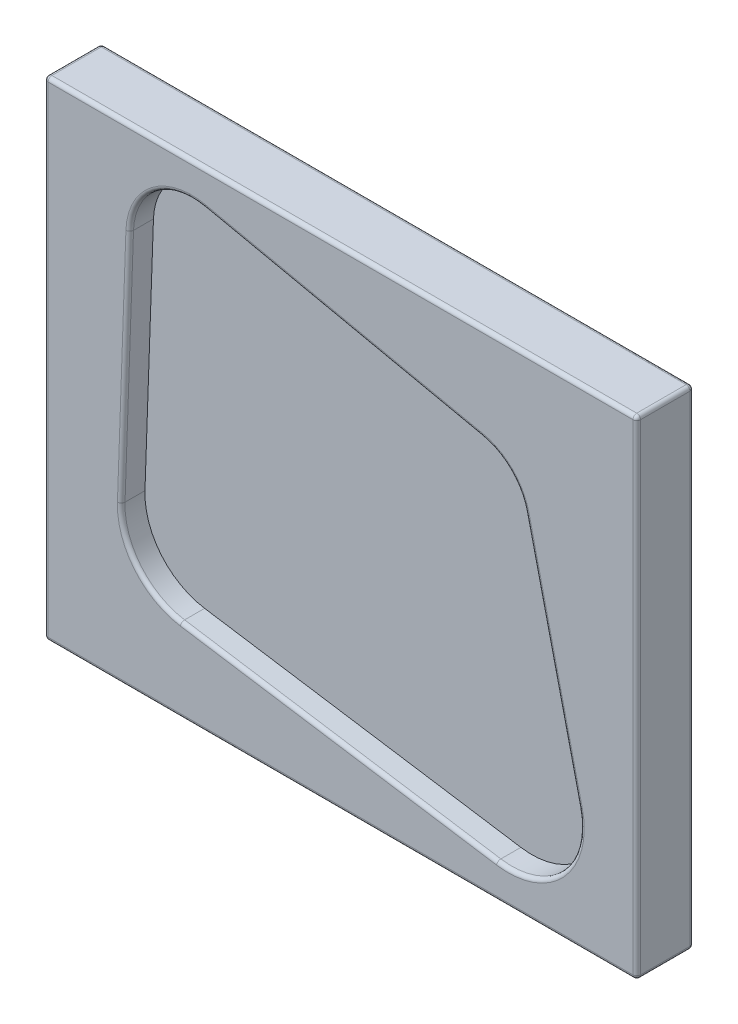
from build123d import *

# Parameters (mm, degrees)
SKETCH1_W          = 792.263130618
SKETCH1_H          = 653.081769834
EXTRUDE1_DEPTH     = 76.2
CUT_EXTRUDE1_DEPTH = 31.75
FILLET1_R          = 5.08


with BuildPart() as part:
    # Sketch1 → Extrude1 (new body)
    with BuildSketch(Plane.XY):
        with Locations((524.951746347, 445.241554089)):
            Rectangle(SKETCH1_W, SKETCH1_H)
    extrude(amount=-EXTRUDE1_DEPTH)

    # Sketch2 → Cut-Extrude1 (cut)
    with BuildSketch(Plane.XY):
        with BuildLine():
            Line((243.052510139, 646.950525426), (231.701983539, 326.501160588))
            ThreePointArc((231.701983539, 326.501160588), (253.25068719, 263.136418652), (311.446331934, 230.080343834))
            Line((311.446331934, 230.080343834), (734.36491768, 164.708553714))
            ThreePointArc((734.36491768, 164.708553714), (820.003495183, 194.505790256), (843.275354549, 282.142893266))
            Line((843.275354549, 282.142893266), (771.98992791, 588.468991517))
            ThreePointArc((771.98992791, 588.468991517), (751.227352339, 625.465592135), (713.872428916, 645.576352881))
            Line((713.872428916, 645.576352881), (343.192461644, 725.013729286))
            ThreePointArc((343.192461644, 725.013729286), (274.907850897, 709.347971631), (243.052510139, 646.950525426))
        make_face()
    extrude(amount=-CUT_EXTRUDE1_DEPTH, mode=Mode.SUBTRACT)

    # Fillet1
    fillet1_edges = [part.edges().sort_by_distance(p)[0] for p in [
        (921.083311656, 445.241554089, -76.2),
        (524.951746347, 771.782439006, -76.2),
        (274.907850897, 709.347971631, 0),
        (237.377246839, 486.725843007, 0),
        (253.25068719, 263.136418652, 0),
        (522.905624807, 197.394448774, 0),
        (820.003495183, 194.505790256, 0),
        (807.632641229, 435.305942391, 0),
        (751.227352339, 625.465592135, 0),
        (528.53244528, 685.295041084, 0),
        (128.820181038, 445.241554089, -76.2),
        (524.951746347, 771.782439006, 0),
        (921.083311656, 445.241554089, 0),
        (524.951746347, 118.700669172, 0),
        (128.820181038, 445.241554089, 0),
        (524.951746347, 118.700669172, -76.2),
        (128.820181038, 771.782439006, -38.1),
        (921.083311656, 771.782439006, -38.1),
        (921.083311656, 118.700669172, -38.1),
        (128.820181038, 118.700669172, -38.1),
    ]]
    fillet(fillet1_edges, radius=FILLET1_R)


solid = part.part
